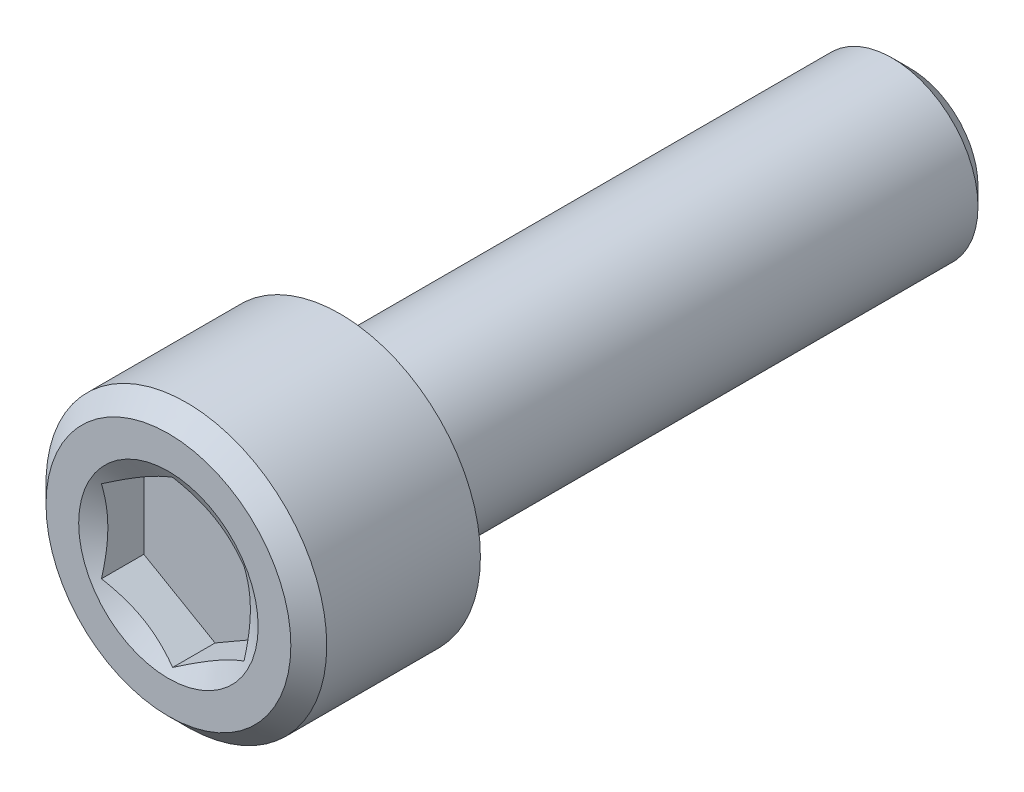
ISO-10303-21;
HEADER;
FILE_DESCRIPTION(('STEP AP214'),'2;1');
FILE_NAME('part.step','',(''),(''),'','','');
FILE_SCHEMA(('AUTOMOTIVE_DESIGN { 1 0 10303 214 1 1 1 1 }'));
ENDSEC;
DATA;
#1=APPLICATION_CONTEXT('core data for automotive mechanical design processes');
#2=APPLICATION_PROTOCOL_DEFINITION('international standard','automotive_design',2000,#1);
#3=PRODUCT_CONTEXT('',#1,'mechanical');
#4=PRODUCT('Part','Part','',(#3));
#5=PRODUCT_RELATED_PRODUCT_CATEGORY('part','',(#4));
#6=PRODUCT_DEFINITION_FORMATION('','',#4);
#7=PRODUCT_DEFINITION_CONTEXT('part definition',#1,'design');
#8=PRODUCT_DEFINITION('design','',#6,#7);
#9=PRODUCT_DEFINITION_SHAPE('','',#8);
#10=(LENGTH_UNIT() NAMED_UNIT(*) SI_UNIT(.MILLI.,.METRE.));
#11=(NAMED_UNIT(*) PLANE_ANGLE_UNIT() SI_UNIT($,.RADIAN.));
#12=(NAMED_UNIT(*) SI_UNIT($,.STERADIAN.) SOLID_ANGLE_UNIT());
#13=UNCERTAINTY_MEASURE_WITH_UNIT(LENGTH_MEASURE(1.E-05),#10,'distance_accuracy_value','');
#14=(GEOMETRIC_REPRESENTATION_CONTEXT(3) GLOBAL_UNCERTAINTY_ASSIGNED_CONTEXT((#13)) GLOBAL_UNIT_ASSIGNED_CONTEXT((#10,
#11,#12)) REPRESENTATION_CONTEXT('',''));
#15=CARTESIAN_POINT('',(0.,0.,0.));
#16=DIRECTION('',(0.,0.,1.));
#17=DIRECTION('',(1.,0.,0.));
#18=AXIS2_PLACEMENT_3D('',#15,#16,#17);
#19=CARTESIAN_POINT('',(0.,0.,0.));
#20=DIRECTION('',(0.,0.,1.));
#21=DIRECTION('',(1.,0.,0.));
#22=AXIS2_PLACEMENT_3D('',#19,#20,#21);
#23=PLANE('',#22);
#24=CARTESIAN_POINT('',(0.,0.,0.));
#25=DIRECTION('',(0.,0.,1.));
#26=DIRECTION('',(1.,0.,0.));
#27=AXIS2_PLACEMENT_3D('',#24,#25,#26);
#28=CIRCLE('',#27,3.91);
#29=CARTESIAN_POINT('',(3.91,0.,0.));
#30=VERTEX_POINT('',#29);
#31=EDGE_CURVE('E118',#30,#30,#28,.T.);
#32=ORIENTED_EDGE('',*,*,#31,.F.);
#33=EDGE_LOOP('',(#32));
#34=FACE_BOUND('',#33,.T.);
#35=CARTESIAN_POINT('',(0.,0.,0.));
#36=DIRECTION('',(0.,0.,1.));
#37=DIRECTION('',(1.,0.,0.));
#38=AXIS2_PLACEMENT_3D('',#35,#36,#37);
#39=CIRCLE('',#38,2.39);
#40=CARTESIAN_POINT('',(2.39,0.,0.));
#41=VERTEX_POINT('',#40);
#42=EDGE_CURVE('E121',#41,#41,#39,.F.);
#43=ORIENTED_EDGE('',*,*,#42,.F.);
#44=EDGE_LOOP('',(#43));
#45=FACE_BOUND('',#44,.T.);
#46=ADVANCED_FACE('F36',(#34,#45),#23,.F.);
#47=CARTESIAN_POINT('',(0.,0.,4.78));
#48=DIRECTION('',(0.,0.,-1.));
#49=DIRECTION('',(-1.,0.,0.));
#50=AXIS2_PLACEMENT_3D('',#47,#48,#49);
#51=CYLINDRICAL_SURFACE('',#50,3.91);
#52=CARTESIAN_POINT('',(0.,0.,4.28));
#53=DIRECTION('',(0.,0.,1.));
#54=DIRECTION('',(1.,0.,0.));
#55=AXIS2_PLACEMENT_3D('',#52,#53,#54);
#56=CIRCLE('',#55,3.91);
#57=CARTESIAN_POINT('',(3.91,0.,4.28));
#58=VERTEX_POINT('',#57);
#59=EDGE_CURVE('E127',#58,#58,#56,.F.);
#60=ORIENTED_EDGE('',*,*,#59,.T.);
#61=EDGE_LOOP('',(#60));
#62=FACE_BOUND('',#61,.T.);
#63=ORIENTED_EDGE('',*,*,#31,.T.);
#64=EDGE_LOOP('',(#63));
#65=FACE_BOUND('',#64,.T.);
#66=ADVANCED_FACE('F144',(#62,#65),#51,.T.);
#67=CARTESIAN_POINT('',(0.,0.,4.78));
#68=DIRECTION('',(0.,0.,1.));
#69=DIRECTION('',(1.,0.,0.));
#70=AXIS2_PLACEMENT_3D('',#67,#68,#69);
#71=PLANE('',#70);
#72=CARTESIAN_POINT('',(0.,0.,4.78));
#73=DIRECTION('',(0.,0.,1.));
#74=DIRECTION('',(1.,0.,0.));
#75=AXIS2_PLACEMENT_3D('',#72,#73,#74);
#76=CIRCLE('',#75,3.41);
#77=CARTESIAN_POINT('',(3.41,0.,4.78));
#78=VERTEX_POINT('',#77);
#79=EDGE_CURVE('E124',#78,#78,#76,.T.);
#80=ORIENTED_EDGE('',*,*,#79,.T.);
#81=EDGE_LOOP('',(#80));
#82=FACE_BOUND('',#81,.T.);
#83=CARTESIAN_POINT('',(0.,0.,4.78));
#84=DIRECTION('',(0.,0.,1.));
#85=DIRECTION('',(1.,0.,0.));
#86=AXIS2_PLACEMENT_3D('',#83,#84,#85);
#87=CIRCLE('',#86,2.5);
#88=CARTESIAN_POINT('',(2.5,0.,4.78));
#89=VERTEX_POINT('',#88);
#90=EDGE_CURVE('E95',#89,#89,#87,.T.);
#91=ORIENTED_EDGE('',*,*,#90,.F.);
#92=EDGE_LOOP('',(#91));
#93=FACE_BOUND('',#92,.T.);
#94=ADVANCED_FACE('F150',(#82,#93),#71,.T.);
#95=CARTESIAN_POINT('',(0.,0.,1.38579367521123));
#96=DIRECTION('',(0.,0.,1.));
#97=DIRECTION('',(1.,0.,0.));
#98=AXIS2_PLACEMENT_3D('',#95,#96,#97);
#99=CYLINDRICAL_SURFACE('',#98,2.39);
#100=CARTESIAN_POINT('',(0.,0.,-15.38));
#101=DIRECTION('',(0.,0.,1.));
#102=DIRECTION('',(1.,0.,0.));
#103=AXIS2_PLACEMENT_3D('',#100,#101,#102);
#104=CIRCLE('',#103,2.39);
#105=CARTESIAN_POINT('',(2.39,0.,-15.38));
#106=VERTEX_POINT('',#105);
#107=EDGE_CURVE('E44',#106,#106,#104,.T.);
#108=ORIENTED_EDGE('',*,*,#107,.T.);
#109=EDGE_LOOP('',(#108));
#110=FACE_BOUND('',#109,.T.);
#111=ORIENTED_EDGE('',*,*,#42,.T.);
#112=EDGE_LOOP('',(#111));
#113=FACE_BOUND('',#112,.T.);
#114=ADVANCED_FACE('F132',(#110,#113),#99,.T.);
#115=CARTESIAN_POINT('',(0.,0.,-15.88));
#116=DIRECTION('',(0.,0.,1.));
#117=DIRECTION('',(1.,0.,0.));
#118=AXIS2_PLACEMENT_3D('',#115,#116,#117);
#119=PLANE('',#118);
#120=CARTESIAN_POINT('',(0.,0.,-15.88));
#121=DIRECTION('',(0.,0.,1.));
#122=DIRECTION('',(1.,0.,0.));
#123=AXIS2_PLACEMENT_3D('',#120,#121,#122);
#124=CIRCLE('',#123,1.89);
#125=CARTESIAN_POINT('',(1.89,0.,-15.88));
#126=VERTEX_POINT('',#125);
#127=EDGE_CURVE('E11',#126,#126,#124,.F.);
#128=ORIENTED_EDGE('',*,*,#127,.T.);
#129=EDGE_LOOP('',(#128));
#130=FACE_BOUND('',#129,.T.);
#131=ADVANCED_FACE('F159',(#130),#119,.F.);
#132=CARTESIAN_POINT('',(0.,0.,4.78));
#133=DIRECTION('',(0.,0.,1.));
#134=DIRECTION('',(1.,0.,0.));
#135=AXIS2_PLACEMENT_3D('',#132,#133,#134);
#136=CONICAL_SURFACE('',#135,2.5,1.0471975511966);
#137=ORIENTED_EDGE('',*,*,#90,.T.);
#138=EDGE_LOOP('',(#137));
#139=FACE_BOUND('',#138,.T.);
#140=CARTESIAN_POINT('',(1.985,-3.00732149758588,5.41702553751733));
#141=CARTESIAN_POINT('',(1.985,-2.9211625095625,5.37552185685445));
#142=CARTESIAN_POINT('',(1.985,-2.83479784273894,5.33443741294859));
#143=CARTESIAN_POINT('',(1.985,-2.66154741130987,5.25334446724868));
#144=CARTESIAN_POINT('',(1.985,-2.57466155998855,5.21333615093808));
#145=CARTESIAN_POINT('',(1.985,-2.39977647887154,5.134416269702));
#146=CARTESIAN_POINT('',(1.985,-2.3117737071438,5.09551252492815));
#147=CARTESIAN_POINT('',(1.985,-2.13504242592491,5.01939627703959));
#148=CARTESIAN_POINT('',(1.985,-2.04631395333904,4.982183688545));
#149=CARTESIAN_POINT('',(1.985,-1.86547969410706,4.9088813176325));
#150=CARTESIAN_POINT('',(1.985,-1.77334906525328,4.87285246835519));
#151=CARTESIAN_POINT('',(1.985,-1.58798422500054,4.8036977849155));
#152=CARTESIAN_POINT('',(1.985,-1.49474988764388,4.77057228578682));
#153=CARTESIAN_POINT('',(1.985,-1.3072318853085,4.70814732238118));
#154=CARTESIAN_POINT('',(1.985,-1.2129510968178,4.67883930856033));
#155=CARTESIAN_POINT('',(1.985,-1.02303224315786,4.62503167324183));
#156=CARTESIAN_POINT('',(1.985,-0.927394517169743,4.60053087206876));
#157=CARTESIAN_POINT('',(1.985,-0.735202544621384,4.55768114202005));
#158=CARTESIAN_POINT('',(1.985,-0.638654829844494,4.5393034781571));
#159=CARTESIAN_POINT('',(1.985,-0.444438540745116,4.50979528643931));
#160=CARTESIAN_POINT('',(1.985,-0.34677005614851,4.49866418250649));
#161=CARTESIAN_POINT('',(1.985,-0.152040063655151,4.48468618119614));
#162=CARTESIAN_POINT('',(1.985,-0.0549860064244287,4.48173844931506));
#163=CARTESIAN_POINT('',(1.985,0.139017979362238,4.48410417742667));
#164=CARTESIAN_POINT('',(1.985,0.235967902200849,4.48941806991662));
#165=CARTESIAN_POINT('',(1.985,0.472892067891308,4.51203083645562));
#166=CARTESIAN_POINT('',(1.985,0.612453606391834,4.53366968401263));
#167=CARTESIAN_POINT('',(1.985,0.88889668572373,4.59008588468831));
#168=CARTESIAN_POINT('',(1.985,1.02577532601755,4.62487671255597));
#169=CARTESIAN_POINT('',(1.985,1.29980088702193,4.70476027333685));
#170=CARTESIAN_POINT('',(1.985,1.4368832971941,4.75006903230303));
#171=CARTESIAN_POINT('',(1.985,1.64061043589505,4.82312129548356));
#172=CARTESIAN_POINT('',(1.985,1.70819482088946,4.84831666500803));
#173=CARTESIAN_POINT('',(1.985,1.84281536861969,4.90013243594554));
#174=CARTESIAN_POINT('',(1.985,1.90985154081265,4.92675281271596));
#175=CARTESIAN_POINT('',(1.985,2.08203358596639,4.99689527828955));
#176=CARTESIAN_POINT('',(1.985,2.18682044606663,5.04129638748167));
#177=CARTESIAN_POINT('',(1.985,2.3954246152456,5.13232699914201));
#178=CARTESIAN_POINT('',(1.985,2.49924184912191,5.17895667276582));
#179=CARTESIAN_POINT('',(1.985,2.80957805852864,5.32140561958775));
#180=CARTESIAN_POINT('',(1.985,3.01492947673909,5.41976295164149));
#181=CARTESIAN_POINT('',(1.985,3.42383667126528,5.6207354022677));
#182=CARTESIAN_POINT('',(1.985,3.62738983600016,5.72335576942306));
#183=CARTESIAN_POINT('',(1.985,4.0330643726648,5.93130696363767));
#184=CARTESIAN_POINT('',(1.985,4.23518595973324,6.03663737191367));
#185=CARTESIAN_POINT('',(1.985,4.61907238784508,6.23895369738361));
#186=CARTESIAN_POINT('',(1.985,4.80092740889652,6.33576911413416));
#187=CARTESIAN_POINT('',(1.985,5.16404277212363,6.53052754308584));
#188=CARTESIAN_POINT('',(1.985,5.34530308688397,6.62847060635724));
#189=CARTESIAN_POINT('',(1.985,5.70687846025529,6.8249357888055));
#190=CARTESIAN_POINT('',(1.985,5.88719475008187,6.92345564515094));
#191=CARTESIAN_POINT('',(1.985,6.24745496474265,7.12114801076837));
#192=CARTESIAN_POINT('',(1.985,6.42739891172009,7.2203204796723));
#193=CARTESIAN_POINT('',(1.985,6.607209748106,7.31973222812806));
#194=B_SPLINE_CURVE_WITH_KNOTS('',3,(#140,#141,#142,#143,#144,#145,#146,#147,#148,#149,#150,
#151,#152,#153,#154,#155,#156,#157,#158,#159,#160,#161,#162,#163,#164,#165,#166,#167,#168,#169,
#170,#171,#172,#173,#174,#175,#176,#177,#178,#179,#180,#181,#182,#183,#184,#185,#186,#187,#188,
#189,#190,#191,#192,#193),.UNSPECIFIED.,.F.,.F.,(4,2,2,2,2,2,2,2,2,2,2,2,2,2,2,2,2,2,2,2,2,2,2,
2,2,2,4),(0.,0.2869068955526,0.573862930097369,0.862504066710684,1.15113061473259,
1.4478674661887,1.74463851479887,2.04073305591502,2.33675484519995,2.63136721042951,
2.92595615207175,3.21689874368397,3.5078565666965,3.93066841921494,4.35391463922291,
4.78677340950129,5.00314707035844,5.2195169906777,5.56089765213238,5.90230457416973,
6.5852877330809,7.26913825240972,7.95288372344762,8.57094093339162,9.18902624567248,
9.80545089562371,10.4218377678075),.UNSPECIFIED.);
#195=CARTESIAN_POINT('',(1.985,-1.14604028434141,4.65995766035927));
#196=VERTEX_POINT('',#195);
#197=CARTESIAN_POINT('',(1.985,1.14604028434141,4.65995766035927));
#198=VERTEX_POINT('',#197);
#199=EDGE_CURVE('E102',#196,#198,#194,.T.);
#200=ORIENTED_EDGE('',*,*,#199,.F.);
#201=CARTESIAN_POINT('',(-0.000200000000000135,-2.29219603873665,4.66002433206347));
#202=CARTESIAN_POINT('',(0.0870321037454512,-2.24183256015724,4.6309341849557));
#203=CARTESIAN_POINT('',(0.175017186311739,-2.19103434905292,4.60447738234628));
#204=CARTESIAN_POINT('',(0.352511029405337,-2.08855823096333,4.55829590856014));
#205=CARTESIAN_POINT('',(0.442022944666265,-2.03687850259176,4.53858757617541));
#206=CARTESIAN_POINT('',(0.619937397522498,-1.93415954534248,4.50790750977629));
#207=CARTESIAN_POINT('',(0.708312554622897,-1.88313612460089,4.49673160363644));
#208=CARTESIAN_POINT('',(0.885478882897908,-1.78084909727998,4.48338785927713));
#209=CARTESIAN_POINT('',(0.974269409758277,-1.72958586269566,4.48120897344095));
#210=CARTESIAN_POINT('',(1.14019134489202,-1.63379078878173,4.48573235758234));
#211=CARTESIAN_POINT('',(1.2173475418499,-1.58924463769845,4.49132398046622));
#212=CARTESIAN_POINT('',(1.37115724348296,-1.50044256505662,4.50904908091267));
#213=CARTESIAN_POINT('',(1.44781021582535,-1.45618695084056,4.52118861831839));
#214=CARTESIAN_POINT('',(1.6019372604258,-1.36720166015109,4.5515376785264));
#215=CARTESIAN_POINT('',(1.67939181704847,-1.32248325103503,4.56987590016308));
#216=CARTESIAN_POINT('',(1.83314545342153,-1.23371354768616,4.61149689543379));
#217=CARTESIAN_POINT('',(1.90944650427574,-1.18966111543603,4.63476988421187));
#218=CARTESIAN_POINT('',(1.9852,-1.14592481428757,4.66002433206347));
#219=B_SPLINE_CURVE_WITH_KNOTS('',3,(#201,#202,#203,#204,#205,#206,#207,#208,#209,#210,#211,
#212,#213,#214,#215,#216,#217,#218),.UNSPECIFIED.,.F.,.F.,(4,2,2,2,2,2,2,2,4),(0.,
0.314654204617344,0.630064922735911,0.937668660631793,1.24489457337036,1.51244266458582,
1.78023878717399,2.05397649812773,2.3271764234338),.UNSPECIFIED.);
#220=CARTESIAN_POINT('',(0.,-2.29208056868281,4.65995766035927));
#221=VERTEX_POINT('',#220);
#222=EDGE_CURVE('E207',#221,#196,#219,.T.);
#223=ORIENTED_EDGE('',*,*,#222,.F.);
#224=CARTESIAN_POINT('',(-1.9852,-1.14592481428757,4.66002433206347));
#225=CARTESIAN_POINT('',(-1.89796789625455,-1.19628829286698,4.6309341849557));
#226=CARTESIAN_POINT('',(-1.80998281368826,-1.2470865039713,4.60447738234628));
#227=CARTESIAN_POINT('',(-1.63248897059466,-1.34956262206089,4.55829590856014));
#228=CARTESIAN_POINT('',(-1.54297705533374,-1.40124235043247,4.53858757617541));
#229=CARTESIAN_POINT('',(-1.3650626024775,-1.50396130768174,4.50790750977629));
#230=CARTESIAN_POINT('',(-1.2766874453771,-1.55498472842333,4.49673160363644));
#231=CARTESIAN_POINT('',(-1.09952111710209,-1.65727175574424,4.48338785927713));
#232=CARTESIAN_POINT('',(-1.01073059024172,-1.70853499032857,4.48120897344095));
#233=CARTESIAN_POINT('',(-0.844808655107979,-1.8043300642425,4.48573235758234));
#234=CARTESIAN_POINT('',(-0.767652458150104,-1.84887621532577,4.49132398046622));
#235=CARTESIAN_POINT('',(-0.613842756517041,-1.9376782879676,4.50904908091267));
#236=CARTESIAN_POINT('',(-0.537189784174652,-1.98193390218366,4.52118861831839));
#237=CARTESIAN_POINT('',(-0.383062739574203,-2.07091919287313,4.5515376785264));
#238=CARTESIAN_POINT('',(-0.305608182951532,-2.1156376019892,4.56987590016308));
#239=CARTESIAN_POINT('',(-0.151854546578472,-2.20440730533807,4.61149689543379));
#240=CARTESIAN_POINT('',(-0.0755534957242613,-2.2484597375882,4.63476988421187));
#241=CARTESIAN_POINT('',(0.000199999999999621,-2.29219603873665,4.66002433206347));
#242=B_SPLINE_CURVE_WITH_KNOTS('',3,(#224,#225,#226,#227,#228,#229,#230,#231,#232,#233,#234,
#235,#236,#237,#238,#239,#240,#241),.UNSPECIFIED.,.F.,.F.,(4,2,2,2,2,2,2,2,4),(0.,
0.314654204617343,0.630064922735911,0.937668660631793,1.24489457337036,1.51244266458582,
1.78023878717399,2.05397649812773,2.3271764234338),.UNSPECIFIED.);
#243=CARTESIAN_POINT('',(-1.985,-1.14604028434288,4.65995766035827));
#244=VERTEX_POINT('',#243);
#245=EDGE_CURVE('E202',#244,#221,#242,.T.);
#246=ORIENTED_EDGE('',*,*,#245,.F.);
#247=CARTESIAN_POINT('',(-1.985,-3.00732149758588,5.41702553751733));
#248=CARTESIAN_POINT('',(-1.985,-2.9211625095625,5.37552185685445));
#249=CARTESIAN_POINT('',(-1.985,-2.83479784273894,5.33443741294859));
#250=CARTESIAN_POINT('',(-1.985,-2.66154741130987,5.25334446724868));
#251=CARTESIAN_POINT('',(-1.985,-2.57466155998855,5.21333615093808));
#252=CARTESIAN_POINT('',(-1.985,-2.39977647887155,5.134416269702));
#253=CARTESIAN_POINT('',(-1.985,-2.3117737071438,5.09551252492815));
#254=CARTESIAN_POINT('',(-1.985,-2.13504242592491,5.01939627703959));
#255=CARTESIAN_POINT('',(-1.985,-2.04631395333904,4.982183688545));
#256=CARTESIAN_POINT('',(-1.985,-1.86547969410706,4.9088813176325));
#257=CARTESIAN_POINT('',(-1.985,-1.77334906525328,4.87285246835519));
#258=CARTESIAN_POINT('',(-1.985,-1.58798422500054,4.8036977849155));
#259=CARTESIAN_POINT('',(-1.985,-1.49474988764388,4.77057228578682));
#260=CARTESIAN_POINT('',(-1.985,-1.3072318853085,4.70814732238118));
#261=CARTESIAN_POINT('',(-1.985,-1.2129510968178,4.67883930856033));
#262=CARTESIAN_POINT('',(-1.985,-1.02303224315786,4.62503167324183));
#263=CARTESIAN_POINT('',(-1.985,-0.927394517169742,4.60053087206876));
#264=CARTESIAN_POINT('',(-1.985,-0.735202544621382,4.55768114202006));
#265=CARTESIAN_POINT('',(-1.985,-0.638654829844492,4.5393034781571));
#266=CARTESIAN_POINT('',(-1.985,-0.444438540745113,4.50979528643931));
#267=CARTESIAN_POINT('',(-1.985,-0.346770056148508,4.49866418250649));
#268=CARTESIAN_POINT('',(-1.985,-0.152040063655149,4.48468618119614));
#269=CARTESIAN_POINT('',(-1.985,-0.0549860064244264,4.48173844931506));
#270=CARTESIAN_POINT('',(-1.985,0.139017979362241,4.48410417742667));
#271=CARTESIAN_POINT('',(-1.985,0.235967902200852,4.48941806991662));
#272=CARTESIAN_POINT('',(-1.985,0.472892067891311,4.51203083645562));
#273=CARTESIAN_POINT('',(-1.985,0.612453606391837,4.53366968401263));
#274=CARTESIAN_POINT('',(-1.985,0.888896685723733,4.59008588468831));
#275=CARTESIAN_POINT('',(-1.985,1.02577532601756,4.62487671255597));
#276=CARTESIAN_POINT('',(-1.985,1.29980088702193,4.70476027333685));
#277=CARTESIAN_POINT('',(-1.985,1.4368832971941,4.75006903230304));
#278=CARTESIAN_POINT('',(-1.985,1.64061043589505,4.82312129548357));
#279=CARTESIAN_POINT('',(-1.985,1.70819482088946,4.84831666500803));
#280=CARTESIAN_POINT('',(-1.985,1.84281536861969,4.90013243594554));
#281=CARTESIAN_POINT('',(-1.985,1.90985154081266,4.92675281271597));
#282=CARTESIAN_POINT('',(-1.985,2.0820335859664,4.99689527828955));
#283=CARTESIAN_POINT('',(-1.985,2.18682044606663,5.04129638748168));
#284=CARTESIAN_POINT('',(-1.985,2.39542461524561,5.13232699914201));
#285=CARTESIAN_POINT('',(-1.985,2.49924184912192,5.17895667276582));
#286=CARTESIAN_POINT('',(-1.985,2.80957805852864,5.32140561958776));
#287=CARTESIAN_POINT('',(-1.985,3.01492947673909,5.41976295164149));
#288=CARTESIAN_POINT('',(-1.985,3.42383667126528,5.6207354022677));
#289=CARTESIAN_POINT('',(-1.985,3.62738983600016,5.72335576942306));
#290=CARTESIAN_POINT('',(-1.985,4.03306437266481,5.93130696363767));
#291=CARTESIAN_POINT('',(-1.985,4.23518595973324,6.03663737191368));
#292=CARTESIAN_POINT('',(-1.985,4.61907238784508,6.23895369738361));
#293=CARTESIAN_POINT('',(-1.985,4.80092740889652,6.33576911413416));
#294=CARTESIAN_POINT('',(-1.985,5.16404277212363,6.53052754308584));
#295=CARTESIAN_POINT('',(-1.985,5.34530308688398,6.62847060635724));
#296=CARTESIAN_POINT('',(-1.985,5.70687846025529,6.8249357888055));
#297=CARTESIAN_POINT('',(-1.985,5.88719475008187,6.92345564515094));
#298=CARTESIAN_POINT('',(-1.985,6.24745496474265,7.12114801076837));
#299=CARTESIAN_POINT('',(-1.985,6.42739891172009,7.2203204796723));
#300=CARTESIAN_POINT('',(-1.985,6.607209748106,7.31973222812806));
#301=B_SPLINE_CURVE_WITH_KNOTS('',3,(#247,#248,#249,#250,#251,#252,#253,#254,#255,#256,#257,
#258,#259,#260,#261,#262,#263,#264,#265,#266,#267,#268,#269,#270,#271,#272,#273,#274,#275,#276,
#277,#278,#279,#280,#281,#282,#283,#284,#285,#286,#287,#288,#289,#290,#291,#292,#293,#294,#295,
#296,#297,#298,#299,#300),.UNSPECIFIED.,.F.,.F.,(4,2,2,2,2,2,2,2,2,2,2,2,2,2,2,2,2,2,2,2,2,2,2,
2,2,2,4),(0.,0.286906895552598,0.573862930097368,0.862504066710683,1.15113061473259,
1.4478674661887,1.74463851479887,2.04073305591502,2.33675484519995,2.63136721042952,
2.92595615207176,3.21689874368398,3.5078565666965,3.93066841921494,4.35391463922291,
4.78677340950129,5.00314707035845,5.21951699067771,5.56089765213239,5.90230457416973,
6.5852877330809,7.26913825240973,7.95288372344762,8.57094093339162,9.18902624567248,
9.80545089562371,10.4218377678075),.UNSPECIFIED.);
#302=CARTESIAN_POINT('',(-1.985,1.14604028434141,4.65995766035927));
#303=VERTEX_POINT('',#302);
#304=EDGE_CURVE('E51',#303,#244,#301,.F.);
#305=ORIENTED_EDGE('',*,*,#304,.F.);
#306=CARTESIAN_POINT('',(0.000200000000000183,2.29219603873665,4.66002433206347));
#307=CARTESIAN_POINT('',(-0.0870321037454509,2.24183256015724,4.6309341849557));
#308=CARTESIAN_POINT('',(-0.175017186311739,2.19103434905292,4.60447738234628));
#309=CARTESIAN_POINT('',(-0.352511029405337,2.08855823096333,4.55829590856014));
#310=CARTESIAN_POINT('',(-0.442022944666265,2.03687850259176,4.53858757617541));
#311=CARTESIAN_POINT('',(-0.619937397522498,1.93415954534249,4.50790750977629));
#312=CARTESIAN_POINT('',(-0.708312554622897,1.88313612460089,4.49673160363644));
#313=CARTESIAN_POINT('',(-0.885478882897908,1.78084909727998,4.48338785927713));
#314=CARTESIAN_POINT('',(-0.974269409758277,1.72958586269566,4.48120897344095));
#315=CARTESIAN_POINT('',(-1.14019134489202,1.63379078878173,4.48573235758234));
#316=CARTESIAN_POINT('',(-1.2173475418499,1.58924463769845,4.49132398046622));
#317=CARTESIAN_POINT('',(-1.37115724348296,1.50044256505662,4.50904908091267));
#318=CARTESIAN_POINT('',(-1.44781021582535,1.45618695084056,4.52118861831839));
#319=CARTESIAN_POINT('',(-1.6019372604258,1.36720166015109,4.5515376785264));
#320=CARTESIAN_POINT('',(-1.67939181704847,1.32248325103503,4.56987590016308));
#321=CARTESIAN_POINT('',(-1.83314545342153,1.23371354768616,4.61149689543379));
#322=CARTESIAN_POINT('',(-1.90944650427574,1.18966111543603,4.63476988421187));
#323=CARTESIAN_POINT('',(-1.9852,1.14592481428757,4.66002433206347));
#324=B_SPLINE_CURVE_WITH_KNOTS('',3,(#306,#307,#308,#309,#310,#311,#312,#313,#314,#315,#316,
#317,#318,#319,#320,#321,#322,#323),.UNSPECIFIED.,.F.,.F.,(4,2,2,2,2,2,2,2,4),(0.,
0.314654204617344,0.630064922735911,0.937668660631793,1.24489457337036,1.51244266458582,
1.78023878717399,2.05397649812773,2.3271764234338),.UNSPECIFIED.);
#325=CARTESIAN_POINT('',(0.,2.29208056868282,4.65995766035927));
#326=VERTEX_POINT('',#325);
#327=EDGE_CURVE('E88',#326,#303,#324,.T.);
#328=ORIENTED_EDGE('',*,*,#327,.F.);
#329=CARTESIAN_POINT('',(1.9852,1.14592481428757,4.66002433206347));
#330=CARTESIAN_POINT('',(1.89796789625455,1.19628829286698,4.6309341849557));
#331=CARTESIAN_POINT('',(1.80998281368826,1.2470865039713,4.60447738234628));
#332=CARTESIAN_POINT('',(1.63248897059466,1.34956262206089,4.55829590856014));
#333=CARTESIAN_POINT('',(1.54297705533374,1.40124235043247,4.53858757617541));
#334=CARTESIAN_POINT('',(1.3650626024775,1.50396130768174,4.50790750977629));
#335=CARTESIAN_POINT('',(1.2766874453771,1.55498472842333,4.49673160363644));
#336=CARTESIAN_POINT('',(1.09952111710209,1.65727175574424,4.48338785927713));
#337=CARTESIAN_POINT('',(1.01073059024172,1.70853499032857,4.48120897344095));
#338=CARTESIAN_POINT('',(0.844808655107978,1.8043300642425,4.48573235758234));
#339=CARTESIAN_POINT('',(0.767652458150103,1.84887621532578,4.49132398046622));
#340=CARTESIAN_POINT('',(0.61384275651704,1.9376782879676,4.50904908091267));
#341=CARTESIAN_POINT('',(0.537189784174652,1.98193390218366,4.52118861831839));
#342=CARTESIAN_POINT('',(0.383062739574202,2.07091919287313,4.5515376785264));
#343=CARTESIAN_POINT('',(0.305608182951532,2.1156376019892,4.56987590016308));
#344=CARTESIAN_POINT('',(0.151854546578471,2.20440730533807,4.61149689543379));
#345=CARTESIAN_POINT('',(0.0755534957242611,2.2484597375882,4.63476988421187));
#346=CARTESIAN_POINT('',(-0.000199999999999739,2.29219603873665,4.66002433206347));
#347=B_SPLINE_CURVE_WITH_KNOTS('',3,(#329,#330,#331,#332,#333,#334,#335,#336,#337,#338,#339,
#340,#341,#342,#343,#344,#345,#346),.UNSPECIFIED.,.F.,.F.,(4,2,2,2,2,2,2,2,4),(0.,
0.314654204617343,0.630064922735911,0.937668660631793,1.24489457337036,1.51244266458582,
1.78023878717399,2.05397649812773,2.3271764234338),.UNSPECIFIED.);
#348=EDGE_CURVE('E91',#198,#326,#347,.T.);
#349=ORIENTED_EDGE('',*,*,#348,.F.);
#350=EDGE_LOOP('',(#200,#223,#246,#305,#328,#349));
#351=FACE_BOUND('',#350,.T.);
#352=ADVANCED_FACE('F90',(#139,#351),#136,.F.);
#353=CARTESIAN_POINT('',(1.985,1.14604028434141,3.48));
#354=DIRECTION('',(0.,0.,-1.));
#355=DIRECTION('',(-1.,0.,0.));
#356=AXIS2_PLACEMENT_3D('',#353,#354,#355);
#357=PLANE('',#356);
#358=DIRECTION('',(-0.866025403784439,0.5,0.));
#359=VECTOR('',#358,1.);
#360=CARTESIAN_POINT('',(1.985,1.14604028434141,3.48));
#361=LINE('',#360,#359);
#362=CARTESIAN_POINT('',(1.985,1.14604028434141,3.48));
#363=VERTEX_POINT('',#362);
#364=CARTESIAN_POINT('',(0.,2.29208056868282,3.48));
#365=VERTEX_POINT('',#364);
#366=EDGE_CURVE('E101',#363,#365,#361,.T.);
#367=ORIENTED_EDGE('',*,*,#366,.T.);
#368=DIRECTION('',(-0.866025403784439,-0.5,0.));
#369=VECTOR('',#368,1.);
#370=CARTESIAN_POINT('',(0.,2.29208056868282,3.48));
#371=LINE('',#370,#369);
#372=CARTESIAN_POINT('',(-1.985,1.14604028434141,3.48));
#373=VERTEX_POINT('',#372);
#374=EDGE_CURVE('E106',#365,#373,#371,.T.);
#375=ORIENTED_EDGE('',*,*,#374,.T.);
#376=DIRECTION('',(0.,-1.,0.));
#377=VECTOR('',#376,1.);
#378=CARTESIAN_POINT('',(-1.985,1.14604028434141,3.48));
#379=LINE('',#378,#377);
#380=CARTESIAN_POINT('',(-1.985,-1.14604028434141,3.48));
#381=VERTEX_POINT('',#380);
#382=EDGE_CURVE('E232',#373,#381,#379,.T.);
#383=ORIENTED_EDGE('',*,*,#382,.T.);
#384=DIRECTION('',(0.866025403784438,-0.5,0.));
#385=VECTOR('',#384,1.);
#386=CARTESIAN_POINT('',(-1.985,-1.14604028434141,3.48));
#387=LINE('',#386,#385);
#388=CARTESIAN_POINT('',(0.,-2.29208056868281,3.48));
#389=VERTEX_POINT('',#388);
#390=EDGE_CURVE('E236',#381,#389,#387,.T.);
#391=ORIENTED_EDGE('',*,*,#390,.T.);
#392=DIRECTION('',(0.866025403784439,0.5,0.));
#393=VECTOR('',#392,1.);
#394=CARTESIAN_POINT('',(0.,-2.29208056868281,3.48));
#395=LINE('',#394,#393);
#396=CARTESIAN_POINT('',(1.985,-1.14604028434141,3.48));
#397=VERTEX_POINT('',#396);
#398=EDGE_CURVE('E114',#389,#397,#395,.T.);
#399=ORIENTED_EDGE('',*,*,#398,.T.);
#400=DIRECTION('',(0.,1.,0.));
#401=VECTOR('',#400,1.);
#402=CARTESIAN_POINT('',(1.985,-1.14604028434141,3.48));
#403=LINE('',#402,#401);
#404=EDGE_CURVE('E109',#397,#363,#403,.T.);
#405=ORIENTED_EDGE('',*,*,#404,.T.);
#406=EDGE_LOOP('',(#367,#375,#383,#391,#399,#405));
#407=FACE_BOUND('',#406,.T.);
#408=ADVANCED_FACE('F186',(#407),#357,.F.);
#409=CARTESIAN_POINT('',(0.,2.29208056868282,3.48));
#410=DIRECTION('',(-0.5,0.866025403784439,0.));
#411=DIRECTION('',(-0.866025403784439,-0.5,0.));
#412=AXIS2_PLACEMENT_3D('',#409,#410,#411);
#413=PLANE('',#412);
#414=DIRECTION('',(0.,0.,1.));
#415=VECTOR('',#414,1.);
#416=CARTESIAN_POINT('',(0.,2.29208056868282,3.48));
#417=LINE('',#416,#415);
#418=EDGE_CURVE('E99',#365,#326,#417,.T.);
#419=ORIENTED_EDGE('',*,*,#418,.T.);
#420=ORIENTED_EDGE('',*,*,#327,.T.);
#421=DIRECTION('',(0.,0.,1.));
#422=VECTOR('',#421,1.);
#423=CARTESIAN_POINT('',(-1.985,1.14604028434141,3.48));
#424=LINE('',#423,#422);
#425=EDGE_CURVE('E108',#373,#303,#424,.T.);
#426=ORIENTED_EDGE('',*,*,#425,.F.);
#427=ORIENTED_EDGE('',*,*,#374,.F.);
#428=EDGE_LOOP('',(#419,#420,#426,#427));
#429=FACE_BOUND('',#428,.T.);
#430=ADVANCED_FACE('F104',(#429),#413,.F.);
#431=CARTESIAN_POINT('',(-1.985,1.14604028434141,3.48));
#432=DIRECTION('',(-1.,0.,0.));
#433=DIRECTION('',(0.,0.,1.));
#434=AXIS2_PLACEMENT_3D('',#431,#432,#433);
#435=PLANE('',#434);
#436=ORIENTED_EDGE('',*,*,#425,.T.);
#437=ORIENTED_EDGE('',*,*,#304,.T.);
#438=DIRECTION('',(0.,0.,1.));
#439=VECTOR('',#438,1.);
#440=CARTESIAN_POINT('',(-1.985,-1.14604028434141,3.48));
#441=LINE('',#440,#439);
#442=EDGE_CURVE('E111',#381,#244,#441,.T.);
#443=ORIENTED_EDGE('',*,*,#442,.F.);
#444=ORIENTED_EDGE('',*,*,#382,.F.);
#445=EDGE_LOOP('',(#436,#437,#443,#444));
#446=FACE_BOUND('',#445,.T.);
#447=ADVANCED_FACE('F221',(#446),#435,.F.);
#448=CARTESIAN_POINT('',(-1.985,-1.14604028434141,3.48));
#449=DIRECTION('',(-0.5,-0.866025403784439,0.));
#450=DIRECTION('',(0.866025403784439,-0.5,0.));
#451=AXIS2_PLACEMENT_3D('',#448,#449,#450);
#452=PLANE('',#451);
#453=ORIENTED_EDGE('',*,*,#442,.T.);
#454=ORIENTED_EDGE('',*,*,#245,.T.);
#455=DIRECTION('',(0.,0.,1.));
#456=VECTOR('',#455,1.);
#457=CARTESIAN_POINT('',(0.,-2.29208056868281,3.48));
#458=LINE('',#457,#456);
#459=EDGE_CURVE('E246',#389,#221,#458,.T.);
#460=ORIENTED_EDGE('',*,*,#459,.F.);
#461=ORIENTED_EDGE('',*,*,#390,.F.);
#462=EDGE_LOOP('',(#453,#454,#460,#461));
#463=FACE_BOUND('',#462,.T.);
#464=ADVANCED_FACE('F216',(#463),#452,.F.);
#465=CARTESIAN_POINT('',(0.,-2.29208056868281,3.48));
#466=DIRECTION('',(0.5,-0.866025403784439,0.));
#467=DIRECTION('',(0.866025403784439,0.5,0.));
#468=AXIS2_PLACEMENT_3D('',#465,#466,#467);
#469=PLANE('',#468);
#470=ORIENTED_EDGE('',*,*,#459,.T.);
#471=ORIENTED_EDGE('',*,*,#222,.T.);
#472=DIRECTION('',(0.,0.,1.));
#473=VECTOR('',#472,1.);
#474=CARTESIAN_POINT('',(1.985,-1.14604028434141,3.48));
#475=LINE('',#474,#473);
#476=EDGE_CURVE('E243',#397,#196,#475,.T.);
#477=ORIENTED_EDGE('',*,*,#476,.F.);
#478=ORIENTED_EDGE('',*,*,#398,.F.);
#479=EDGE_LOOP('',(#470,#471,#477,#478));
#480=FACE_BOUND('',#479,.T.);
#481=ADVANCED_FACE('F213',(#480),#469,.F.);
#482=CARTESIAN_POINT('',(1.985,-1.14604028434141,3.48));
#483=DIRECTION('',(1.,0.,0.));
#484=DIRECTION('',(0.,1.,0.));
#485=AXIS2_PLACEMENT_3D('',#482,#483,#484);
#486=PLANE('',#485);
#487=ORIENTED_EDGE('',*,*,#476,.T.);
#488=ORIENTED_EDGE('',*,*,#199,.T.);
#489=DIRECTION('',(0.,0.,1.));
#490=VECTOR('',#489,1.);
#491=CARTESIAN_POINT('',(1.985,1.14604028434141,3.48));
#492=LINE('',#491,#490);
#493=EDGE_CURVE('E59',#363,#198,#492,.T.);
#494=ORIENTED_EDGE('',*,*,#493,.F.);
#495=ORIENTED_EDGE('',*,*,#404,.F.);
#496=EDGE_LOOP('',(#487,#488,#494,#495));
#497=FACE_BOUND('',#496,.T.);
#498=ADVANCED_FACE('F168',(#497),#486,.F.);
#499=CARTESIAN_POINT('',(1.985,1.14604028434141,3.48));
#500=DIRECTION('',(0.5,0.866025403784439,0.));
#501=DIRECTION('',(-0.866025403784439,0.5,0.));
#502=AXIS2_PLACEMENT_3D('',#499,#500,#501);
#503=PLANE('',#502);
#504=ORIENTED_EDGE('',*,*,#493,.T.);
#505=ORIENTED_EDGE('',*,*,#348,.T.);
#506=ORIENTED_EDGE('',*,*,#418,.F.);
#507=ORIENTED_EDGE('',*,*,#366,.F.);
#508=EDGE_LOOP('',(#504,#505,#506,#507));
#509=FACE_BOUND('',#508,.T.);
#510=ADVANCED_FACE('F98',(#509),#503,.F.);
#511=CARTESIAN_POINT('',(0.,0.,4.78));
#512=DIRECTION('',(0.,0.,-1.));
#513=DIRECTION('',(-1.,0.,0.));
#514=AXIS2_PLACEMENT_3D('',#511,#512,#513);
#515=CONICAL_SURFACE('',#514,3.41,0.785398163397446);
#516=ORIENTED_EDGE('',*,*,#59,.F.);
#517=EDGE_LOOP('',(#516));
#518=FACE_BOUND('',#517,.T.);
#519=ORIENTED_EDGE('',*,*,#79,.F.);
#520=EDGE_LOOP('',(#519));
#521=FACE_BOUND('',#520,.T.);
#522=ADVANCED_FACE('F136',(#518,#521),#515,.T.);
#523=CARTESIAN_POINT('',(0.,0.,-15.38));
#524=DIRECTION('',(0.,0.,1.));
#525=DIRECTION('',(1.,0.,0.));
#526=AXIS2_PLACEMENT_3D('',#523,#524,#525);
#527=CONICAL_SURFACE('',#526,2.39,0.785398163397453);
#528=ORIENTED_EDGE('',*,*,#127,.F.);
#529=EDGE_LOOP('',(#528));
#530=FACE_BOUND('',#529,.T.);
#531=ORIENTED_EDGE('',*,*,#107,.F.);
#532=EDGE_LOOP('',(#531));
#533=FACE_BOUND('',#532,.T.);
#534=ADVANCED_FACE('F38',(#530,#533),#527,.T.);
#535=CLOSED_SHELL('',(#46,#66,#94,#114,#131,#352,#408,#430,#447,#464,#481,#498,#510,#522,#534));
#536=MANIFOLD_SOLID_BREP('B2',#535);
#537=ADVANCED_BREP_SHAPE_REPRESENTATION('',(#18,#536),#14);
#538=SHAPE_DEFINITION_REPRESENTATION(#9,#537);
ENDSEC;
END-ISO-10303-21;
